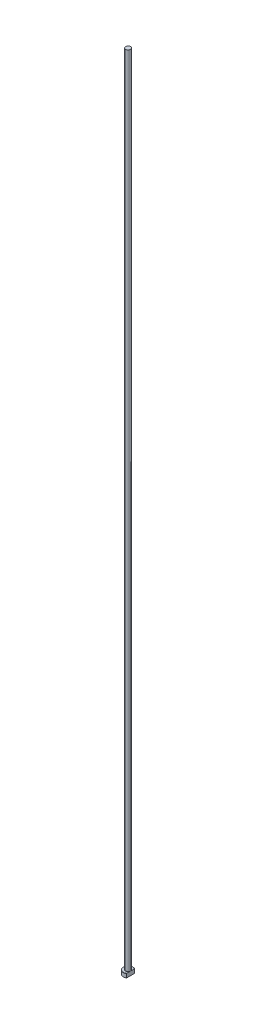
from build123d import *
from build123d.topology import SkipClean

# Parameters (mm, degrees)
CHAMFER1_SIZE = 0.2
FILLET1_R     = 0.2
KEY_DEPTH     = 1001.035999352


with BuildPart() as part:
    # Sketch1 → Revolve1 (revolve)
    with BuildSketch(Plane.XY, mode=Mode.PRIVATE) as revolve1_sk:
        Polygon((0, 0), (-6, 0), (-6, 5), (-3, 5), (-3, 1000), (0, 1000), align=None)
    revolve(revolve1_sk.sketch.rotate(Axis((0, 259.958771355, 0), (0, -1, 0)), 270), axis=Axis((0, 259.958771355, 0), (0, -1, 0)))

    # Chamfer1
    chamfer1_edges = [part.edges().sort_by_distance(p)[0] for p in [
        (0, 5, -6),
        (0, 0, -6),
    ]]
    chamfer(chamfer1_edges, length=CHAMFER1_SIZE)

    # Fillet1
    fillet1_edges = [part.edges().sort_by_distance(p)[0] for p in [
        (0, 5, -3),
    ]]
    fillet(fillet1_edges, radius=FILLET1_R)

    # Sketch2 → KEY (cut, through all)
    with SkipClean():  # the faces are left unmerged after this step: merging them gives an invalid solid
        with BuildSketch(Plane(origin=(0, 0, 0), x_dir=(1, 0, 0), z_dir=(0, 1, 0))):
            with BuildLine():
                Line((3, 5.196152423), (3, -5.196152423))
                ThreePointArc((3, -5.196152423), (6, 0), (3, 5.196152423))
            make_face()
        extrude(amount=KEY_DEPTH, mode=Mode.SUBTRACT)


solid = part.part
